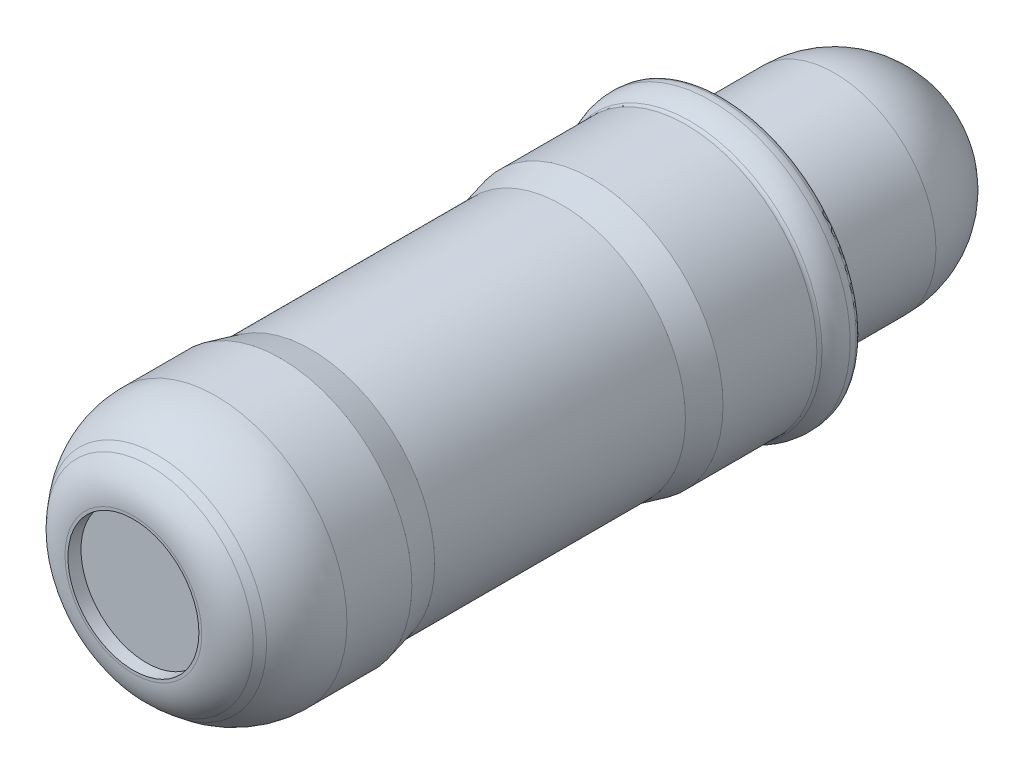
ISO-10303-21;
HEADER;
FILE_DESCRIPTION(('STEP AP214'),'2;1');
FILE_NAME('part.step','',(''),(''),'','','');
FILE_SCHEMA(('AUTOMOTIVE_DESIGN { 1 0 10303 214 1 1 1 1 }'));
ENDSEC;
DATA;
#1=APPLICATION_CONTEXT('core data for automotive mechanical design processes');
#2=APPLICATION_PROTOCOL_DEFINITION('international standard','automotive_design',2000,#1);
#3=PRODUCT_CONTEXT('',#1,'mechanical');
#4=PRODUCT('Part','Part','',(#3));
#5=PRODUCT_RELATED_PRODUCT_CATEGORY('part','',(#4));
#6=PRODUCT_DEFINITION_FORMATION('','',#4);
#7=PRODUCT_DEFINITION_CONTEXT('part definition',#1,'design');
#8=PRODUCT_DEFINITION('design','',#6,#7);
#9=PRODUCT_DEFINITION_SHAPE('','',#8);
#10=(LENGTH_UNIT() NAMED_UNIT(*) SI_UNIT(.MILLI.,.METRE.));
#11=(NAMED_UNIT(*) PLANE_ANGLE_UNIT() SI_UNIT($,.RADIAN.));
#12=(NAMED_UNIT(*) SI_UNIT($,.STERADIAN.) SOLID_ANGLE_UNIT());
#13=UNCERTAINTY_MEASURE_WITH_UNIT(LENGTH_MEASURE(1.E-05),#10,'distance_accuracy_value','');
#14=(GEOMETRIC_REPRESENTATION_CONTEXT(3) GLOBAL_UNCERTAINTY_ASSIGNED_CONTEXT((#13)) GLOBAL_UNIT_ASSIGNED_CONTEXT((#10,
#11,#12)) REPRESENTATION_CONTEXT('',''));
#15=CARTESIAN_POINT('',(0.,0.,0.));
#16=DIRECTION('',(0.,0.,1.));
#17=DIRECTION('',(1.,0.,0.));
#18=AXIS2_PLACEMENT_3D('',#15,#16,#17);
#19=CARTESIAN_POINT('',(0.,0.,6.5));
#20=DIRECTION('',(0.,0.,1.));
#21=DIRECTION('',(1.,0.,0.));
#22=AXIS2_PLACEMENT_3D('',#19,#20,#21);
#23=CYLINDRICAL_SURFACE('',#22,2.);
#24=CARTESIAN_POINT('',(0.,0.,24.5));
#25=DIRECTION('',(0.,0.,1.));
#26=DIRECTION('',(1.,0.,0.));
#27=AXIS2_PLACEMENT_3D('',#24,#25,#26);
#28=CIRCLE('',#27,2.);
#29=CARTESIAN_POINT('',(2.,0.,24.5));
#30=VERTEX_POINT('',#29);
#31=EDGE_CURVE('E150',#30,#30,#28,.F.);
#32=ORIENTED_EDGE('',*,*,#31,.F.);
#33=EDGE_LOOP('',(#32));
#34=FACE_BOUND('',#33,.T.);
#35=CARTESIAN_POINT('',(0.,0.,24.1));
#36=DIRECTION('',(0.,0.,1.));
#37=DIRECTION('',(1.,0.,0.));
#38=AXIS2_PLACEMENT_3D('',#35,#36,#37);
#39=CIRCLE('',#38,2.);
#40=CARTESIAN_POINT('',(2.,0.,24.1));
#41=VERTEX_POINT('',#40);
#42=EDGE_CURVE('E157',#41,#41,#39,.T.);
#43=ORIENTED_EDGE('',*,*,#42,.F.);
#44=EDGE_LOOP('',(#43));
#45=FACE_BOUND('',#44,.T.);
#46=ADVANCED_FACE('F12',(#34,#45),#23,.F.);
#47=CARTESIAN_POINT('',(0.,3.09,6.5));
#48=DIRECTION('',(0.,0.,-1.));
#49=DIRECTION('',(-1.,0.,0.));
#50=AXIS2_PLACEMENT_3D('',#47,#48,#49);
#51=PLANE('',#50);
#52=CARTESIAN_POINT('',(0.,0.,6.5));
#53=DIRECTION('',(0.,0.,-1.));
#54=DIRECTION('',(-1.,0.,0.));
#55=AXIS2_PLACEMENT_3D('',#52,#53,#54);
#56=CIRCLE('',#55,3.1);
#57=CARTESIAN_POINT('',(-3.1,0.,6.5));
#58=VERTEX_POINT('',#57);
#59=EDGE_CURVE('E16',#58,#58,#56,.F.);
#60=ORIENTED_EDGE('',*,*,#59,.T.);
#61=EDGE_LOOP('',(#60));
#62=FACE_BOUND('',#61,.T.);
#63=CARTESIAN_POINT('',(0.,0.,6.49999999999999));
#64=DIRECTION('',(0.,0.,1.));
#65=DIRECTION('',(-1.,0.,0.));
#66=AXIS2_PLACEMENT_3D('',#63,#64,#65);
#67=CIRCLE('',#66,4.03363078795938);
#68=CARTESIAN_POINT('',(-4.03363078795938,0.,6.49999999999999));
#69=VERTEX_POINT('',#68);
#70=EDGE_CURVE('E146',#69,#69,#67,.T.);
#71=ORIENTED_EDGE('',*,*,#70,.F.);
#72=EDGE_LOOP('',(#71));
#73=FACE_BOUND('',#72,.T.);
#74=ADVANCED_FACE('F128',(#62,#73),#51,.T.);
#75=CARTESIAN_POINT('',(0.,2.08851983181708,24.5));
#76=DIRECTION('',(0.,0.,1.));
#77=DIRECTION('',(1.,0.,0.));
#78=AXIS2_PLACEMENT_3D('',#75,#76,#77);
#79=PLANE('',#78);
#80=CARTESIAN_POINT('',(0.,0.,24.5));
#81=DIRECTION('',(0.,0.,-1.));
#82=DIRECTION('',(-1.,0.,0.));
#83=AXIS2_PLACEMENT_3D('',#80,#81,#82);
#84=CIRCLE('',#83,2.08851983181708);
#85=CARTESIAN_POINT('',(-2.08851983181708,0.,24.5));
#86=VERTEX_POINT('',#85);
#87=EDGE_CURVE('E115',#86,#86,#84,.T.);
#88=ORIENTED_EDGE('',*,*,#87,.F.);
#89=EDGE_LOOP('',(#88));
#90=FACE_BOUND('',#89,.T.);
#91=ORIENTED_EDGE('',*,*,#31,.T.);
#92=EDGE_LOOP('',(#91));
#93=FACE_BOUND('',#92,.T.);
#94=ADVANCED_FACE('F119',(#90,#93),#79,.T.);
#95=CARTESIAN_POINT('',(0.,0.,6.7));
#96=DIRECTION('',(0.,0.,-1.));
#97=DIRECTION('',(-1.,0.,0.));
#98=AXIS2_PLACEMENT_3D('',#95,#96,#97);
#99=TOROIDAL_SURFACE('',#98,4.03363085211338,0.200000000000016);
#100=ORIENTED_EDGE('',*,*,#70,.T.);
#101=EDGE_LOOP('',(#100));
#102=FACE_BOUND('',#101,.T.);
#103=CARTESIAN_POINT('',(0.,0.,6.663));
#104=DIRECTION('',(0.,0.,-1.));
#105=DIRECTION('',(-1.,0.,0.));
#106=AXIS2_PLACEMENT_3D('',#103,#104,#105);
#107=CIRCLE('',#106,4.23017855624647);
#108=CARTESIAN_POINT('',(-4.23017855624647,0.,6.663));
#109=VERTEX_POINT('',#108);
#110=EDGE_CURVE('E86',#109,#109,#107,.F.);
#111=ORIENTED_EDGE('',*,*,#110,.F.);
#112=EDGE_LOOP('',(#111));
#113=FACE_BOUND('',#112,.T.);
#114=ADVANCED_FACE('F101',(#102,#113),#99,.T.);
#115=CARTESIAN_POINT('',(0.,0.,23.1));
#116=DIRECTION('',(0.,0.,-1.));
#117=DIRECTION('',(-1.,0.,0.));
#118=AXIS2_PLACEMENT_3D('',#115,#116,#117);
#119=TOROIDAL_SURFACE('',#118,2.08851983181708,1.4);
#120=CARTESIAN_POINT('',(0.,0.,23.9999026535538));
#121=DIRECTION('',(0.,0.,-1.));
#122=DIRECTION('',(-1.,0.,0.));
#123=AXIS2_PLACEMENT_3D('',#120,#121,#122);
#124=CIRCLE('',#123,3.16098205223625);
#125=CARTESIAN_POINT('',(-3.16098205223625,0.,23.9999026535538));
#126=VERTEX_POINT('',#125);
#127=EDGE_CURVE('E81',#126,#126,#124,.T.);
#128=ORIENTED_EDGE('',*,*,#127,.F.);
#129=EDGE_LOOP('',(#128));
#130=FACE_BOUND('',#129,.T.);
#131=ORIENTED_EDGE('',*,*,#87,.T.);
#132=EDGE_LOOP('',(#131));
#133=FACE_BOUND('',#132,.T.);
#134=ADVANCED_FACE('F95',(#130,#133),#119,.T.);
#135=CARTESIAN_POINT('',(0.,0.,6.868));
#136=DIRECTION('',(0.,0.,-1.));
#137=DIRECTION('',(-1.,0.,0.));
#138=AXIS2_PLACEMENT_3D('',#135,#136,#137);
#139=TOROIDAL_SURFACE('',#138,3.17999999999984,1.07000000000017);
#140=ORIENTED_EDGE('',*,*,#110,.T.);
#141=EDGE_LOOP('',(#140));
#142=FACE_BOUND('',#141,.T.);
#143=CARTESIAN_POINT('',(0.,0.,6.868));
#144=DIRECTION('',(0.,0.,-1.));
#145=DIRECTION('',(-1.,0.,0.));
#146=AXIS2_PLACEMENT_3D('',#143,#144,#145);
#147=CIRCLE('',#146,4.25);
#148=CARTESIAN_POINT('',(-4.25,0.,6.868));
#149=VERTEX_POINT('',#148);
#150=EDGE_CURVE('E77',#149,#149,#147,.F.);
#151=ORIENTED_EDGE('',*,*,#150,.F.);
#152=EDGE_LOOP('',(#151));
#153=FACE_BOUND('',#152,.T.);
#154=ADVANCED_FACE('F92',(#142,#153),#139,.T.);
#155=CARTESIAN_POINT('',(0.,0.,23.7806886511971));
#156=DIRECTION('',(0.,0.,-1.));
#157=DIRECTION('',(-1.,0.,0.));
#158=AXIS2_PLACEMENT_3D('',#155,#156,#157);
#159=CONICAL_SURFACE('',#158,3.34492444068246,0.698131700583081);
#160=CARTESIAN_POINT('',(0.,0.,23.780688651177));
#161=DIRECTION('',(0.,0.,-1.));
#162=DIRECTION('',(0.,1.,0.));
#163=AXIS2_PLACEMENT_3D('',#160,#161,#162);
#164=CIRCLE('',#163,3.34492444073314);
#165=CARTESIAN_POINT('',(0.,3.34492444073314,23.780688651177));
#166=VERTEX_POINT('',#165);
#167=EDGE_CURVE('E80',#166,#166,#164,.T.);
#168=ORIENTED_EDGE('',*,*,#167,.F.);
#169=EDGE_LOOP('',(#168));
#170=FACE_BOUND('',#169,.T.);
#171=ORIENTED_EDGE('',*,*,#127,.T.);
#172=EDGE_LOOP('',(#171));
#173=FACE_BOUND('',#172,.T.);
#174=ADVANCED_FACE('F69',(#170,#173),#159,.T.);
#175=CARTESIAN_POINT('',(0.,0.,6.868));
#176=DIRECTION('',(0.,0.,-1.));
#177=DIRECTION('',(-1.,0.,0.));
#178=AXIS2_PLACEMENT_3D('',#175,#176,#177);
#179=TOROIDAL_SURFACE('',#178,3.15,1.1);
#180=ORIENTED_EDGE('',*,*,#150,.T.);
#181=EDGE_LOOP('',(#180));
#182=FACE_BOUND('',#181,.T.);
#183=CARTESIAN_POINT('',(0.,0.,7.5165646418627));
#184=DIRECTION('',(0.,0.,-1.));
#185=DIRECTION('',(-1.,0.,0.));
#186=AXIS2_PLACEMENT_3D('',#183,#184,#185);
#187=CIRCLE('',#186,4.03846153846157);
#188=CARTESIAN_POINT('',(-4.03846153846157,0.,7.5165646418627));
#189=VERTEX_POINT('',#188);
#190=EDGE_CURVE('E51',#189,#189,#187,.T.);
#191=ORIENTED_EDGE('',*,*,#190,.T.);
#192=EDGE_LOOP('',(#191));
#193=FACE_BOUND('',#192,.T.);
#194=ADVANCED_FACE('F65',(#182,#193),#179,.T.);
#195=CARTESIAN_POINT('',(0.,0.,21.9808833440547));
#196=DIRECTION('',(0.,0.,-1.));
#197=DIRECTION('',(-1.,0.,0.));
#198=AXIS2_PLACEMENT_3D('',#195,#196,#197);
#199=DEGENERATE_TOROIDAL_SURFACE('',#198,1.20000000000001,2.8,.T.);
#200=CARTESIAN_POINT('',(0.,0.,21.9808833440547));
#201=DIRECTION('',(0.,0.,1.));
#202=DIRECTION('',(1.,0.,0.));
#203=AXIS2_PLACEMENT_3D('',#200,#201,#202);
#204=CIRCLE('',#203,4.);
#205=CARTESIAN_POINT('',(4.,0.,21.9808833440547));
#206=VERTEX_POINT('',#205);
#207=EDGE_CURVE('E46',#206,#206,#204,.F.);
#208=ORIENTED_EDGE('',*,*,#207,.F.);
#209=EDGE_LOOP('',(#208));
#210=FACE_BOUND('',#209,.T.);
#211=ORIENTED_EDGE('',*,*,#167,.T.);
#212=EDGE_LOOP('',(#211));
#213=FACE_BOUND('',#212,.T.);
#214=ADVANCED_FACE('F14',(#210,#213),#199,.T.);
#215=CARTESIAN_POINT('',(0.,0.,7.6344854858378));
#216=DIRECTION('',(0.,0.,-1.));
#217=DIRECTION('',(-1.,0.,0.));
#218=AXIS2_PLACEMENT_3D('',#215,#216,#217);
#219=TOROIDAL_SURFACE('',#218,4.2,0.199999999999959);
#220=CARTESIAN_POINT('',(0.,0.,7.6344854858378));
#221=DIRECTION('',(0.,0.,1.));
#222=DIRECTION('',(1.,0.,0.));
#223=AXIS2_PLACEMENT_3D('',#220,#221,#222);
#224=CIRCLE('',#223,4.);
#225=CARTESIAN_POINT('',(4.,0.,7.6344854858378));
#226=VERTEX_POINT('',#225);
#227=EDGE_CURVE('E41',#226,#226,#224,.T.);
#228=ORIENTED_EDGE('',*,*,#227,.F.);
#229=EDGE_LOOP('',(#228));
#230=FACE_BOUND('',#229,.T.);
#231=ORIENTED_EDGE('',*,*,#190,.F.);
#232=EDGE_LOOP('',(#231));
#233=FACE_BOUND('',#232,.T.);
#234=ADVANCED_FACE('F58',(#230,#233),#219,.F.);
#235=CARTESIAN_POINT('',(0.,0.,6.5));
#236=DIRECTION('',(0.,0.,1.));
#237=DIRECTION('',(1.,0.,0.));
#238=AXIS2_PLACEMENT_3D('',#235,#236,#237);
#239=CYLINDRICAL_SURFACE('',#238,4.);
#240=CARTESIAN_POINT('',(0.,0.,19.9999999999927));
#241=DIRECTION('',(0.,0.,1.));
#242=DIRECTION('',(1.,0.,0.));
#243=AXIS2_PLACEMENT_3D('',#240,#241,#242);
#244=CIRCLE('',#243,3.99999999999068);
#245=CARTESIAN_POINT('',(3.99999999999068,0.,19.9999999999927));
#246=VERTEX_POINT('',#245);
#247=EDGE_CURVE('E36',#246,#246,#244,.F.);
#248=ORIENTED_EDGE('',*,*,#247,.F.);
#249=EDGE_LOOP('',(#248));
#250=FACE_BOUND('',#249,.T.);
#251=ORIENTED_EDGE('',*,*,#207,.T.);
#252=EDGE_LOOP('',(#251));
#253=FACE_BOUND('',#252,.T.);
#254=ADVANCED_FACE('F62',(#250,#253),#239,.T.);
#255=CARTESIAN_POINT('',(0.,0.,6.5));
#256=DIRECTION('',(0.,0.,1.));
#257=DIRECTION('',(1.,0.,0.));
#258=AXIS2_PLACEMENT_3D('',#255,#256,#257);
#259=CYLINDRICAL_SURFACE('',#258,4.);
#260=ORIENTED_EDGE('',*,*,#227,.T.);
#261=EDGE_LOOP('',(#260));
#262=FACE_BOUND('',#261,.T.);
#263=CARTESIAN_POINT('',(0.,0.,10.5000000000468));
#264=DIRECTION('',(0.,0.,-1.));
#265=DIRECTION('',(-1.,0.,0.));
#266=AXIS2_PLACEMENT_3D('',#263,#264,#265);
#267=CIRCLE('',#266,3.99999999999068);
#268=CARTESIAN_POINT('',(-3.99999999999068,0.,10.5000000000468));
#269=VERTEX_POINT('',#268);
#270=EDGE_CURVE('E25',#269,#269,#267,.F.);
#271=ORIENTED_EDGE('',*,*,#270,.F.);
#272=EDGE_LOOP('',(#271));
#273=FACE_BOUND('',#272,.T.);
#274=ADVANCED_FACE('F238',(#262,#273),#259,.T.);
#275=CARTESIAN_POINT('',(0.,0.,19.9999999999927));
#276=DIRECTION('',(0.,0.,1.));
#277=DIRECTION('',(1.,0.,0.));
#278=AXIS2_PLACEMENT_3D('',#275,#276,#277);
#279=CONICAL_SURFACE('',#278,3.99999999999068,0.239110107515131);
#280=CARTESIAN_POINT('',(0.,0.,19.0770129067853));
#281=DIRECTION('',(0.,0.,1.));
#282=DIRECTION('',(1.,0.,0.));
#283=AXIS2_PLACEMENT_3D('',#280,#281,#282);
#284=CIRCLE('',#283,3.775);
#285=CARTESIAN_POINT('',(3.775,0.,19.0770129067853));
#286=VERTEX_POINT('',#285);
#287=EDGE_CURVE('E20',#286,#286,#284,.F.);
#288=ORIENTED_EDGE('',*,*,#287,.F.);
#289=EDGE_LOOP('',(#288));
#290=FACE_BOUND('',#289,.T.);
#291=ORIENTED_EDGE('',*,*,#247,.T.);
#292=EDGE_LOOP('',(#291));
#293=FACE_BOUND('',#292,.T.);
#294=ADVANCED_FACE('F245',(#290,#293),#279,.T.);
#295=CARTESIAN_POINT('',(0.,0.,10.5000000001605));
#296=DIRECTION('',(0.,0.,-1.));
#297=DIRECTION('',(-1.,0.,0.));
#298=AXIS2_PLACEMENT_3D('',#295,#296,#297);
#299=CONICAL_SURFACE('',#298,3.99999999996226,0.239110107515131);
#300=ORIENTED_EDGE('',*,*,#270,.T.);
#301=EDGE_LOOP('',(#300));
#302=FACE_BOUND('',#301,.T.);
#303=CARTESIAN_POINT('',(0.,0.,11.4229870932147));
#304=DIRECTION('',(0.,0.,1.));
#305=DIRECTION('',(1.,0.,0.));
#306=AXIS2_PLACEMENT_3D('',#303,#304,#305);
#307=CIRCLE('',#306,3.775);
#308=CARTESIAN_POINT('',(3.775,0.,11.4229870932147));
#309=VERTEX_POINT('',#308);
#310=EDGE_CURVE('E8',#309,#309,#307,.T.);
#311=ORIENTED_EDGE('',*,*,#310,.F.);
#312=EDGE_LOOP('',(#311));
#313=FACE_BOUND('',#312,.T.);
#314=ADVANCED_FACE('F180',(#302,#313),#299,.T.);
#315=CARTESIAN_POINT('',(0.,0.,6.5));
#316=DIRECTION('',(0.,0.,1.));
#317=DIRECTION('',(1.,0.,0.));
#318=AXIS2_PLACEMENT_3D('',#315,#316,#317);
#319=CYLINDRICAL_SURFACE('',#318,3.775);
#320=ORIENTED_EDGE('',*,*,#310,.T.);
#321=EDGE_LOOP('',(#320));
#322=FACE_BOUND('',#321,.T.);
#323=ORIENTED_EDGE('',*,*,#287,.T.);
#324=EDGE_LOOP('',(#323));
#325=FACE_BOUND('',#324,.T.);
#326=ADVANCED_FACE('F170',(#322,#325),#319,.T.);
#327=CARTESIAN_POINT('',(0.,0.,3.1));
#328=DIRECTION('',(0.,0.,1.));
#329=DIRECTION('',(-1.,0.,0.));
#330=AXIS2_PLACEMENT_3D('',#327,#328,#329);
#331=SPHERICAL_SURFACE('',#330,3.1);
#332=CARTESIAN_POINT('',(0.,0.,3.1));
#333=DIRECTION('',(0.,0.,1.));
#334=DIRECTION('',(1.,0.,0.));
#335=AXIS2_PLACEMENT_3D('',#332,#333,#334);
#336=CIRCLE('',#335,3.1);
#337=CARTESIAN_POINT('',(3.1,0.,3.1));
#338=VERTEX_POINT('',#337);
#339=EDGE_CURVE('E29',#338,#338,#336,.T.);
#340=ORIENTED_EDGE('',*,*,#339,.F.);
#341=EDGE_LOOP('',(#340));
#342=FACE_BOUND('',#341,.T.);
#343=ADVANCED_FACE('F168',(#342),#331,.T.);
#344=CARTESIAN_POINT('',(0.,0.,26.9556139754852));
#345=DIRECTION('',(0.,0.,1.));
#346=DIRECTION('',(1.,0.,0.));
#347=AXIS2_PLACEMENT_3D('',#344,#345,#346);
#348=CYLINDRICAL_SURFACE('',#347,3.1);
#349=ORIENTED_EDGE('',*,*,#59,.F.);
#350=EDGE_LOOP('',(#349));
#351=FACE_BOUND('',#350,.T.);
#352=ORIENTED_EDGE('',*,*,#339,.T.);
#353=EDGE_LOOP('',(#352));
#354=FACE_BOUND('',#353,.T.);
#355=ADVANCED_FACE('F166',(#351,#354),#348,.T.);
#356=CARTESIAN_POINT('',(0.,0.,24.1));
#357=DIRECTION('',(0.,0.,-1.));
#358=DIRECTION('',(-1.,0.,0.));
#359=AXIS2_PLACEMENT_3D('',#356,#357,#358);
#360=PLANE('',#359);
#361=ORIENTED_EDGE('',*,*,#42,.T.);
#362=EDGE_LOOP('',(#361));
#363=FACE_BOUND('',#362,.T.);
#364=ADVANCED_FACE('F177',(#363),#360,.F.);
#365=CLOSED_SHELL('',(#46,#74,#94,#114,#134,#154,#174,#194,#214,#234,#254,#274,#294,#314,#326,
#343,#355,#364));
#366=MANIFOLD_SOLID_BREP('B1',#365);
#367=ADVANCED_BREP_SHAPE_REPRESENTATION('',(#18,#366),#14);
#368=SHAPE_DEFINITION_REPRESENTATION(#9,#367);
ENDSEC;
END-ISO-10303-21;
